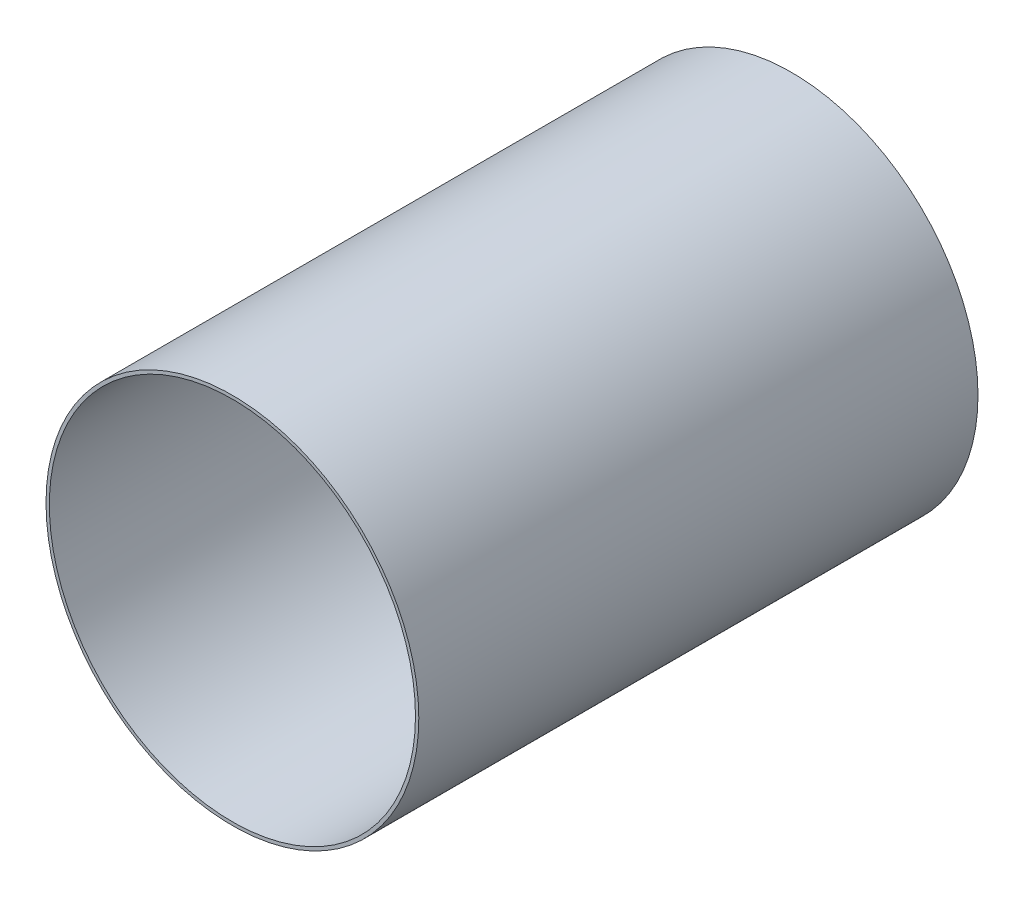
from build123d import *

# Parameters (mm, degrees)
SKETCH1_R      = 711.2
SKETCH1_R_2    = 698.5
EXTRUDE1_DEPTH = 2133.6
SKETCH4_R      = 309.5625
NOZZLE_1_DEPTH = 1018.286


with BuildPart() as part:
    # Sketch1 → Extrude1 (new body)
    with BuildSketch(Plane.XY):
        Circle(SKETCH1_R)
        Circle(SKETCH1_R_2, mode=Mode.SUBTRACT)
    extrude(amount=EXTRUDE1_DEPTH)

    # Sketch4 → Nozzle 1 (cut)
    with BuildSketch(Plane(origin=(0, 0, 0), x_dir=(0, 0, -1), z_dir=(1, 0, 0))):
        with Locations(Location((-762, 0, 0), (0, 0, 180))):
            Circle(SKETCH4_R)
    extrude(amount=-NOZZLE_1_DEPTH, mode=Mode.SUBTRACT)


solid = part.part
